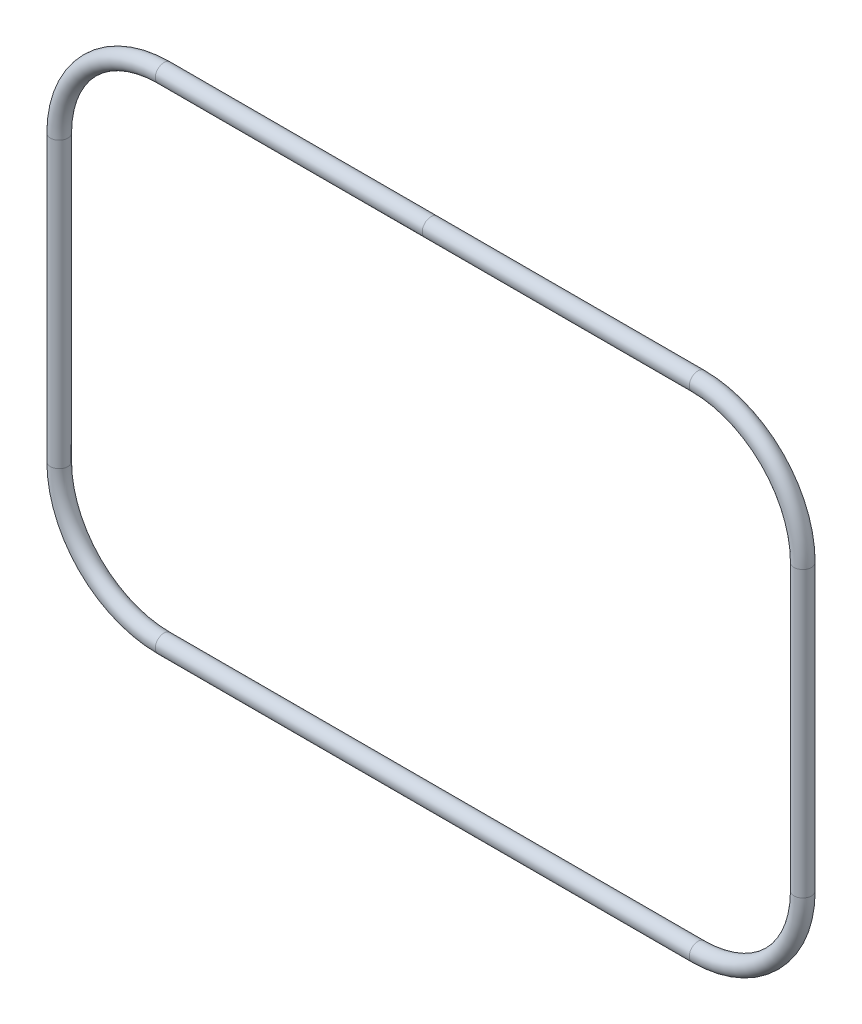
ISO-10303-21;
HEADER;
FILE_DESCRIPTION(('STEP AP214'),'2;1');
FILE_NAME('part.step','',(''),(''),'','','');
FILE_SCHEMA(('AUTOMOTIVE_DESIGN { 1 0 10303 214 1 1 1 1 }'));
ENDSEC;
DATA;
#1=APPLICATION_CONTEXT('core data for automotive mechanical design processes');
#2=APPLICATION_PROTOCOL_DEFINITION('international standard','automotive_design',2000,#1);
#3=PRODUCT_CONTEXT('',#1,'mechanical');
#4=PRODUCT('Part','Part','',(#3));
#5=PRODUCT_RELATED_PRODUCT_CATEGORY('part','',(#4));
#6=PRODUCT_DEFINITION_FORMATION('','',#4);
#7=PRODUCT_DEFINITION_CONTEXT('part definition',#1,'design');
#8=PRODUCT_DEFINITION('design','',#6,#7);
#9=PRODUCT_DEFINITION_SHAPE('','',#8);
#10=(LENGTH_UNIT() NAMED_UNIT(*) SI_UNIT(.MILLI.,.METRE.));
#11=(NAMED_UNIT(*) PLANE_ANGLE_UNIT() SI_UNIT($,.RADIAN.));
#12=(NAMED_UNIT(*) SI_UNIT($,.STERADIAN.) SOLID_ANGLE_UNIT());
#13=UNCERTAINTY_MEASURE_WITH_UNIT(LENGTH_MEASURE(1.E-05),#10,'distance_accuracy_value','');
#14=(GEOMETRIC_REPRESENTATION_CONTEXT(3) GLOBAL_UNCERTAINTY_ASSIGNED_CONTEXT((#13)) GLOBAL_UNIT_ASSIGNED_CONTEXT((#10,
#11,#12)) REPRESENTATION_CONTEXT('',''));
#15=CARTESIAN_POINT('',(0.,0.,0.));
#16=DIRECTION('',(0.,0.,1.));
#17=DIRECTION('',(1.,0.,0.));
#18=AXIS2_PLACEMENT_3D('',#15,#16,#17);
#19=CARTESIAN_POINT('',(-27.178,25.146,0.));
#20=DIRECTION('',(1.,0.,0.));
#21=DIRECTION('',(0.,0.,-1.));
#22=AXIS2_PLACEMENT_3D('',#19,#20,#21);
#23=CYLINDRICAL_SURFACE('',#22,0.889000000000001);
#24=CARTESIAN_POINT('',(-27.178,25.146,0.));
#25=DIRECTION('',(1.,0.,0.));
#26=DIRECTION('',(0.,0.,-1.));
#27=AXIS2_PLACEMENT_3D('',#24,#25,#26);
#28=CIRCLE('',#27,0.889000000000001);
#29=CARTESIAN_POINT('',(-27.178,26.035,0.));
#30=VERTEX_POINT('',#29);
#31=EDGE_CURVE('E42',#30,#30,#28,.T.);
#32=ORIENTED_EDGE('',*,*,#31,.T.);
#33=EDGE_LOOP('',(#32));
#34=FACE_BOUND('',#33,.T.);
#35=CARTESIAN_POINT('',(0.,25.146,0.));
#36=DIRECTION('',(1.,0.,0.));
#37=DIRECTION('',(0.,0.,-1.));
#38=AXIS2_PLACEMENT_3D('',#35,#36,#37);
#39=CIRCLE('',#38,0.889000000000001);
#40=CARTESIAN_POINT('',(0.,25.146,-0.889000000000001));
#41=VERTEX_POINT('',#40);
#42=EDGE_CURVE('E10',#41,#41,#39,.T.);
#43=ORIENTED_EDGE('',*,*,#42,.F.);
#44=EDGE_LOOP('',(#43));
#45=FACE_BOUND('',#44,.T.);
#46=ADVANCED_FACE('F32',(#34,#45),#23,.T.);
#47=CARTESIAN_POINT('',(-27.178,14.478,0.));
#48=DIRECTION('',(0.,0.,-1.));
#49=DIRECTION('',(-1.,0.,0.));
#50=AXIS2_PLACEMENT_3D('',#47,#48,#49);
#51=TOROIDAL_SURFACE('',#50,10.668,0.889000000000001);
#52=CARTESIAN_POINT('',(-37.846,14.478,0.));
#53=DIRECTION('',(0.,1.,0.));
#54=DIRECTION('',(0.,0.,-1.));
#55=AXIS2_PLACEMENT_3D('',#52,#53,#54);
#56=CIRCLE('',#55,0.889000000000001);
#57=CARTESIAN_POINT('',(-38.735,14.478,0.));
#58=VERTEX_POINT('',#57);
#59=EDGE_CURVE('E46',#58,#58,#56,.T.);
#60=CARTESIAN_POINT('',(-27.178,14.478,0.));
#61=DIRECTION('',(0.,0.,-1.));
#62=DIRECTION('',(-1.,0.,0.));
#63=AXIS2_PLACEMENT_3D('',#60,#61,#62);
#64=CIRCLE('',#63,11.557);
#65=EDGE_CURVE('',#58,#30,#64,.T.);
#66=ORIENTED_EDGE('',*,*,#59,.T.);
#67=ORIENTED_EDGE('',*,*,#31,.F.);
#68=ORIENTED_EDGE('',*,*,#65,.T.);
#69=ORIENTED_EDGE('',*,*,#65,.F.);
#70=EDGE_LOOP('',(#66,#68,#67,#69));
#71=FACE_BOUND('',#70,.T.);
#72=ADVANCED_FACE('F65',(#71),#51,.T.);
#73=CARTESIAN_POINT('',(-37.846,-14.478,0.));
#74=DIRECTION('',(0.,1.,0.));
#75=DIRECTION('',(0.,0.,1.));
#76=AXIS2_PLACEMENT_3D('',#73,#74,#75);
#77=CYLINDRICAL_SURFACE('',#76,0.889000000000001);
#78=CARTESIAN_POINT('',(-37.846,-14.478,0.));
#79=DIRECTION('',(0.,1.,0.));
#80=DIRECTION('',(0.,0.,-1.));
#81=AXIS2_PLACEMENT_3D('',#78,#79,#80);
#82=CIRCLE('',#81,0.889000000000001);
#83=CARTESIAN_POINT('',(-38.735,-14.478,0.));
#84=VERTEX_POINT('',#83);
#85=EDGE_CURVE('E51',#84,#84,#82,.T.);
#86=ORIENTED_EDGE('',*,*,#85,.T.);
#87=EDGE_LOOP('',(#86));
#88=FACE_BOUND('',#87,.T.);
#89=ORIENTED_EDGE('',*,*,#59,.F.);
#90=EDGE_LOOP('',(#89));
#91=FACE_BOUND('',#90,.T.);
#92=ADVANCED_FACE('F69',(#88,#91),#77,.T.);
#93=CARTESIAN_POINT('',(-27.178,-14.478,0.));
#94=DIRECTION('',(0.,0.,-1.));
#95=DIRECTION('',(-1.,0.,0.));
#96=AXIS2_PLACEMENT_3D('',#93,#94,#95);
#97=TOROIDAL_SURFACE('',#96,10.668,0.889000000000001);
#98=CARTESIAN_POINT('',(-27.178,-25.146,0.));
#99=DIRECTION('',(-1.,0.,0.));
#100=DIRECTION('',(0.,0.,-1.));
#101=AXIS2_PLACEMENT_3D('',#98,#99,#100);
#102=CIRCLE('',#101,0.889000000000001);
#103=CARTESIAN_POINT('',(-27.178,-26.035,0.));
#104=VERTEX_POINT('',#103);
#105=EDGE_CURVE('E117',#104,#104,#102,.T.);
#106=CARTESIAN_POINT('',(-27.178,-14.478,0.));
#107=DIRECTION('',(0.,0.,-1.));
#108=DIRECTION('',(-1.,0.,0.));
#109=AXIS2_PLACEMENT_3D('',#106,#107,#108);
#110=CIRCLE('',#109,11.557);
#111=EDGE_CURVE('',#104,#84,#110,.T.);
#112=ORIENTED_EDGE('',*,*,#105,.T.);
#113=ORIENTED_EDGE('',*,*,#85,.F.);
#114=ORIENTED_EDGE('',*,*,#111,.T.);
#115=ORIENTED_EDGE('',*,*,#111,.F.);
#116=EDGE_LOOP('',(#112,#114,#113,#115));
#117=FACE_BOUND('',#116,.T.);
#118=ADVANCED_FACE('F74',(#117),#97,.T.);
#119=CARTESIAN_POINT('',(27.178,-25.146,0.));
#120=DIRECTION('',(-1.,0.,0.));
#121=DIRECTION('',(0.,0.,1.));
#122=AXIS2_PLACEMENT_3D('',#119,#120,#121);
#123=CYLINDRICAL_SURFACE('',#122,0.889000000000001);
#124=CARTESIAN_POINT('',(27.178,-25.146,0.));
#125=DIRECTION('',(-1.,0.,0.));
#126=DIRECTION('',(0.,0.,-1.));
#127=AXIS2_PLACEMENT_3D('',#124,#125,#126);
#128=CIRCLE('',#127,0.889000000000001);
#129=CARTESIAN_POINT('',(27.178,-26.035,0.));
#130=VERTEX_POINT('',#129);
#131=EDGE_CURVE('E114',#130,#130,#128,.T.);
#132=ORIENTED_EDGE('',*,*,#131,.T.);
#133=EDGE_LOOP('',(#132));
#134=FACE_BOUND('',#133,.T.);
#135=ORIENTED_EDGE('',*,*,#105,.F.);
#136=EDGE_LOOP('',(#135));
#137=FACE_BOUND('',#136,.T.);
#138=ADVANCED_FACE('F81',(#134,#137),#123,.T.);
#139=CARTESIAN_POINT('',(27.178,-14.478,0.));
#140=DIRECTION('',(0.,0.,-1.));
#141=DIRECTION('',(-1.,0.,0.));
#142=AXIS2_PLACEMENT_3D('',#139,#140,#141);
#143=TOROIDAL_SURFACE('',#142,10.668,0.889000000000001);
#144=CARTESIAN_POINT('',(37.846,-14.478,0.));
#145=DIRECTION('',(0.,-1.,0.));
#146=DIRECTION('',(0.,0.,-1.));
#147=AXIS2_PLACEMENT_3D('',#144,#145,#146);
#148=CIRCLE('',#147,0.889000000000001);
#149=CARTESIAN_POINT('',(38.735,-14.478,0.));
#150=VERTEX_POINT('',#149);
#151=EDGE_CURVE('E109',#150,#150,#148,.T.);
#152=CARTESIAN_POINT('',(27.178,-14.478,0.));
#153=DIRECTION('',(0.,0.,-1.));
#154=DIRECTION('',(-1.,0.,0.));
#155=AXIS2_PLACEMENT_3D('',#152,#153,#154);
#156=CIRCLE('',#155,11.557);
#157=EDGE_CURVE('',#150,#130,#156,.T.);
#158=ORIENTED_EDGE('',*,*,#151,.T.);
#159=ORIENTED_EDGE('',*,*,#131,.F.);
#160=ORIENTED_EDGE('',*,*,#157,.T.);
#161=ORIENTED_EDGE('',*,*,#157,.F.);
#162=EDGE_LOOP('',(#158,#160,#159,#161));
#163=FACE_BOUND('',#162,.T.);
#164=ADVANCED_FACE('F85',(#163),#143,.T.);
#165=CARTESIAN_POINT('',(37.846,14.478,0.));
#166=DIRECTION('',(0.,-1.,0.));
#167=DIRECTION('',(0.,0.,-1.));
#168=AXIS2_PLACEMENT_3D('',#165,#166,#167);
#169=CYLINDRICAL_SURFACE('',#168,0.889000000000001);
#170=CARTESIAN_POINT('',(37.846,14.478,0.));
#171=DIRECTION('',(0.,-1.,0.));
#172=DIRECTION('',(0.,0.,-1.));
#173=AXIS2_PLACEMENT_3D('',#170,#171,#172);
#174=CIRCLE('',#173,0.889000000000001);
#175=CARTESIAN_POINT('',(38.735,14.478,0.));
#176=VERTEX_POINT('',#175);
#177=EDGE_CURVE('E106',#176,#176,#174,.T.);
#178=ORIENTED_EDGE('',*,*,#177,.T.);
#179=EDGE_LOOP('',(#178));
#180=FACE_BOUND('',#179,.T.);
#181=ORIENTED_EDGE('',*,*,#151,.F.);
#182=EDGE_LOOP('',(#181));
#183=FACE_BOUND('',#182,.T.);
#184=ADVANCED_FACE('F89',(#180,#183),#169,.T.);
#185=CARTESIAN_POINT('',(27.178,14.478,0.));
#186=DIRECTION('',(0.,0.,-1.));
#187=DIRECTION('',(-1.,0.,0.));
#188=AXIS2_PLACEMENT_3D('',#185,#186,#187);
#189=TOROIDAL_SURFACE('',#188,10.668,0.889000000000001);
#190=CARTESIAN_POINT('',(27.178,25.146,0.));
#191=DIRECTION('',(1.,0.,0.));
#192=DIRECTION('',(0.,0.,-1.));
#193=AXIS2_PLACEMENT_3D('',#190,#191,#192);
#194=CIRCLE('',#193,0.889000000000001);
#195=CARTESIAN_POINT('',(27.178,26.035,0.));
#196=VERTEX_POINT('',#195);
#197=EDGE_CURVE('E105',#196,#196,#194,.T.);
#198=CARTESIAN_POINT('',(27.178,14.478,0.));
#199=DIRECTION('',(0.,0.,-1.));
#200=DIRECTION('',(-1.,0.,0.));
#201=AXIS2_PLACEMENT_3D('',#198,#199,#200);
#202=CIRCLE('',#201,11.557);
#203=EDGE_CURVE('',#196,#176,#202,.T.);
#204=ORIENTED_EDGE('',*,*,#197,.T.);
#205=ORIENTED_EDGE('',*,*,#177,.F.);
#206=ORIENTED_EDGE('',*,*,#203,.T.);
#207=ORIENTED_EDGE('',*,*,#203,.F.);
#208=EDGE_LOOP('',(#204,#206,#205,#207));
#209=FACE_BOUND('',#208,.T.);
#210=ADVANCED_FACE('F93',(#209),#189,.T.);
#211=CARTESIAN_POINT('',(27.178,25.146,0.));
#212=DIRECTION('',(-1.,0.,0.));
#213=DIRECTION('',(0.,0.,1.));
#214=AXIS2_PLACEMENT_3D('',#211,#212,#213);
#215=CYLINDRICAL_SURFACE('',#214,0.889000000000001);
#216=ORIENTED_EDGE('',*,*,#197,.F.);
#217=EDGE_LOOP('',(#216));
#218=FACE_BOUND('',#217,.T.);
#219=ORIENTED_EDGE('',*,*,#42,.T.);
#220=EDGE_LOOP('',(#219));
#221=FACE_BOUND('',#220,.T.);
#222=ADVANCED_FACE('F96',(#218,#221),#215,.T.);
#223=CLOSED_SHELL('',(#46,#72,#92,#118,#138,#164,#184,#210,#222));
#224=MANIFOLD_SOLID_BREP('B2',#223);
#225=ADVANCED_BREP_SHAPE_REPRESENTATION('',(#18,#224),#14);
#226=SHAPE_DEFINITION_REPRESENTATION(#9,#225);
ENDSEC;
END-ISO-10303-21;
